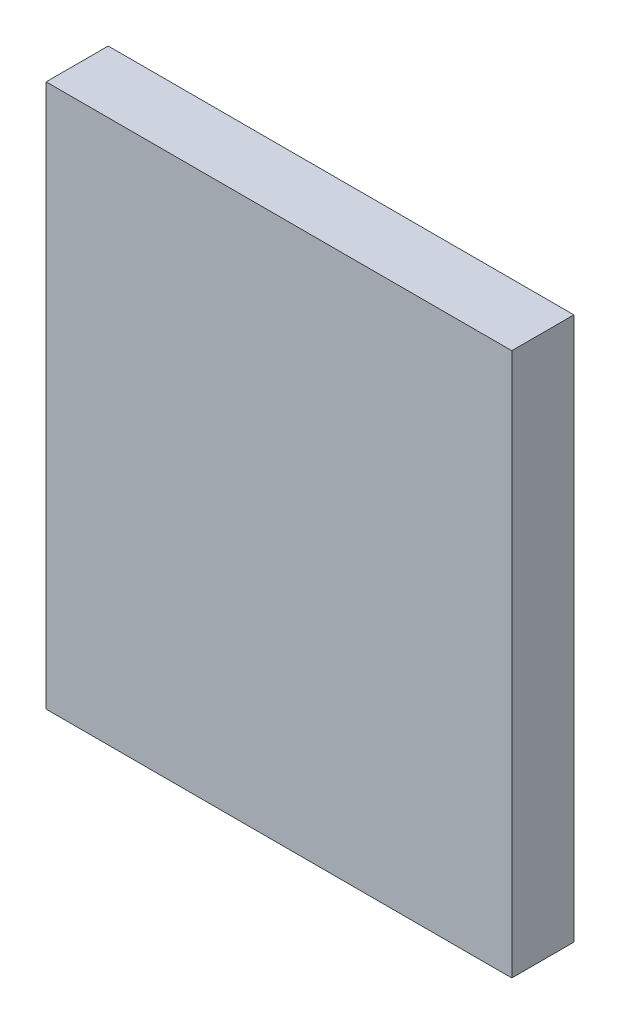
ISO-10303-21;
HEADER;
FILE_DESCRIPTION(('STEP AP214'),'2;1');
FILE_NAME('part.step','',(''),(''),'','','');
FILE_SCHEMA(('AUTOMOTIVE_DESIGN { 1 0 10303 214 1 1 1 1 }'));
ENDSEC;
DATA;
#1=APPLICATION_CONTEXT('core data for automotive mechanical design processes');
#2=APPLICATION_PROTOCOL_DEFINITION('international standard','automotive_design',2000,#1);
#3=PRODUCT_CONTEXT('',#1,'mechanical');
#4=PRODUCT('Part','Part','',(#3));
#5=PRODUCT_RELATED_PRODUCT_CATEGORY('part','',(#4));
#6=PRODUCT_DEFINITION_FORMATION('','',#4);
#7=PRODUCT_DEFINITION_CONTEXT('part definition',#1,'design');
#8=PRODUCT_DEFINITION('design','',#6,#7);
#9=PRODUCT_DEFINITION_SHAPE('','',#8);
#10=(LENGTH_UNIT() NAMED_UNIT(*) SI_UNIT(.MILLI.,.METRE.));
#11=(NAMED_UNIT(*) PLANE_ANGLE_UNIT() SI_UNIT($,.RADIAN.));
#12=(NAMED_UNIT(*) SI_UNIT($,.STERADIAN.) SOLID_ANGLE_UNIT());
#13=UNCERTAINTY_MEASURE_WITH_UNIT(LENGTH_MEASURE(1.E-05),#10,'distance_accuracy_value','');
#14=(GEOMETRIC_REPRESENTATION_CONTEXT(3) GLOBAL_UNCERTAINTY_ASSIGNED_CONTEXT((#13)) GLOBAL_UNIT_ASSIGNED_CONTEXT((#10,
#11,#12)) REPRESENTATION_CONTEXT('',''));
#15=CARTESIAN_POINT('',(0.,0.,0.));
#16=DIRECTION('',(0.,0.,1.));
#17=DIRECTION('',(1.,0.,0.));
#18=AXIS2_PLACEMENT_3D('',#15,#16,#17);
#19=CARTESIAN_POINT('',(0.,0.,8.));
#20=DIRECTION('',(0.,0.,1.));
#21=DIRECTION('',(1.,0.,0.));
#22=AXIS2_PLACEMENT_3D('',#19,#20,#21);
#23=PLANE('',#22);
#24=DIRECTION('',(1.,0.,0.));
#25=VECTOR('',#24,1.);
#26=CARTESIAN_POINT('',(-30.,-35.,8.));
#27=LINE('',#26,#25);
#28=CARTESIAN_POINT('',(-30.,-35.,8.));
#29=VERTEX_POINT('',#28);
#30=CARTESIAN_POINT('',(30.,-35.,8.));
#31=VERTEX_POINT('',#30);
#32=EDGE_CURVE('E82',#29,#31,#27,.T.);
#33=ORIENTED_EDGE('',*,*,#32,.T.);
#34=DIRECTION('',(0.,1.,0.));
#35=VECTOR('',#34,1.);
#36=CARTESIAN_POINT('',(30.,-35.,8.));
#37=LINE('',#36,#35);
#38=CARTESIAN_POINT('',(30.,35.,8.));
#39=VERTEX_POINT('',#38);
#40=EDGE_CURVE('E97',#31,#39,#37,.T.);
#41=ORIENTED_EDGE('',*,*,#40,.T.);
#42=DIRECTION('',(-1.,0.,0.));
#43=VECTOR('',#42,1.);
#44=CARTESIAN_POINT('',(30.,35.,8.));
#45=LINE('',#44,#43);
#46=CARTESIAN_POINT('',(-30.,35.,8.));
#47=VERTEX_POINT('',#46);
#48=EDGE_CURVE('E19',#39,#47,#45,.T.);
#49=ORIENTED_EDGE('',*,*,#48,.T.);
#50=DIRECTION('',(0.,-1.,0.));
#51=VECTOR('',#50,1.);
#52=CARTESIAN_POINT('',(-30.,35.,8.));
#53=LINE('',#52,#51);
#54=EDGE_CURVE('E10',#47,#29,#53,.T.);
#55=ORIENTED_EDGE('',*,*,#54,.T.);
#56=EDGE_LOOP('',(#33,#41,#49,#55));
#57=FACE_BOUND('',#56,.T.);
#58=ADVANCED_FACE('F16',(#57),#23,.T.);
#59=CARTESIAN_POINT('',(0.,0.,0.));
#60=DIRECTION('',(0.,0.,1.));
#61=DIRECTION('',(1.,0.,0.));
#62=AXIS2_PLACEMENT_3D('',#59,#60,#61);
#63=PLANE('',#62);
#64=DIRECTION('',(0.,-1.,0.));
#65=VECTOR('',#64,1.);
#66=CARTESIAN_POINT('',(-30.,35.,0.));
#67=LINE('',#66,#65);
#68=CARTESIAN_POINT('',(-30.,35.,0.));
#69=VERTEX_POINT('',#68);
#70=CARTESIAN_POINT('',(-30.,-35.,0.));
#71=VERTEX_POINT('',#70);
#72=EDGE_CURVE('E25',#69,#71,#67,.T.);
#73=ORIENTED_EDGE('',*,*,#72,.F.);
#74=DIRECTION('',(-1.,0.,0.));
#75=VECTOR('',#74,1.);
#76=CARTESIAN_POINT('',(30.,35.,0.));
#77=LINE('',#76,#75);
#78=CARTESIAN_POINT('',(30.,35.,0.));
#79=VERTEX_POINT('',#78);
#80=EDGE_CURVE('E107',#79,#69,#77,.T.);
#81=ORIENTED_EDGE('',*,*,#80,.F.);
#82=DIRECTION('',(0.,1.,0.));
#83=VECTOR('',#82,1.);
#84=CARTESIAN_POINT('',(30.,-35.,0.));
#85=LINE('',#84,#83);
#86=CARTESIAN_POINT('',(30.,-35.,0.));
#87=VERTEX_POINT('',#86);
#88=EDGE_CURVE('E84',#87,#79,#85,.T.);
#89=ORIENTED_EDGE('',*,*,#88,.F.);
#90=DIRECTION('',(1.,0.,0.));
#91=VECTOR('',#90,1.);
#92=CARTESIAN_POINT('',(-30.,-35.,0.));
#93=LINE('',#92,#91);
#94=EDGE_CURVE('E80',#71,#87,#93,.T.);
#95=ORIENTED_EDGE('',*,*,#94,.F.);
#96=EDGE_LOOP('',(#73,#81,#89,#95));
#97=FACE_BOUND('',#96,.T.);
#98=ADVANCED_FACE('F86',(#97),#63,.F.);
#99=CARTESIAN_POINT('',(-30.,35.,0.));
#100=DIRECTION('',(1.,0.,0.));
#101=DIRECTION('',(0.,1.,0.));
#102=AXIS2_PLACEMENT_3D('',#99,#100,#101);
#103=PLANE('',#102);
#104=ORIENTED_EDGE('',*,*,#72,.T.);
#105=DIRECTION('',(0.,0.,1.));
#106=VECTOR('',#105,1.);
#107=CARTESIAN_POINT('',(-30.,-35.,0.));
#108=LINE('',#107,#106);
#109=EDGE_CURVE('E69',#71,#29,#108,.T.);
#110=ORIENTED_EDGE('',*,*,#109,.T.);
#111=ORIENTED_EDGE('',*,*,#54,.F.);
#112=DIRECTION('',(0.,0.,1.));
#113=VECTOR('',#112,1.);
#114=CARTESIAN_POINT('',(-30.,35.,0.));
#115=LINE('',#114,#113);
#116=EDGE_CURVE('E72',#69,#47,#115,.T.);
#117=ORIENTED_EDGE('',*,*,#116,.F.);
#118=EDGE_LOOP('',(#104,#110,#111,#117));
#119=FACE_BOUND('',#118,.T.);
#120=ADVANCED_FACE('F68',(#119),#103,.F.);
#121=CARTESIAN_POINT('',(30.,35.,0.));
#122=DIRECTION('',(0.,-1.,0.));
#123=DIRECTION('',(0.,0.,-1.));
#124=AXIS2_PLACEMENT_3D('',#121,#122,#123);
#125=PLANE('',#124);
#126=ORIENTED_EDGE('',*,*,#80,.T.);
#127=ORIENTED_EDGE('',*,*,#116,.T.);
#128=ORIENTED_EDGE('',*,*,#48,.F.);
#129=DIRECTION('',(0.,0.,1.));
#130=VECTOR('',#129,1.);
#131=CARTESIAN_POINT('',(30.,35.,0.));
#132=LINE('',#131,#130);
#133=EDGE_CURVE('E103',#79,#39,#132,.T.);
#134=ORIENTED_EDGE('',*,*,#133,.F.);
#135=EDGE_LOOP('',(#126,#127,#128,#134));
#136=FACE_BOUND('',#135,.T.);
#137=ADVANCED_FACE('F118',(#136),#125,.F.);
#138=CARTESIAN_POINT('',(30.,-35.,0.));
#139=DIRECTION('',(-1.,0.,0.));
#140=DIRECTION('',(0.,0.,1.));
#141=AXIS2_PLACEMENT_3D('',#138,#139,#140);
#142=PLANE('',#141);
#143=ORIENTED_EDGE('',*,*,#88,.T.);
#144=ORIENTED_EDGE('',*,*,#133,.T.);
#145=ORIENTED_EDGE('',*,*,#40,.F.);
#146=DIRECTION('',(0.,0.,1.));
#147=VECTOR('',#146,1.);
#148=CARTESIAN_POINT('',(30.,-35.,0.));
#149=LINE('',#148,#147);
#150=EDGE_CURVE('E90',#87,#31,#149,.T.);
#151=ORIENTED_EDGE('',*,*,#150,.F.);
#152=EDGE_LOOP('',(#143,#144,#145,#151));
#153=FACE_BOUND('',#152,.T.);
#154=ADVANCED_FACE('F120',(#153),#142,.F.);
#155=CARTESIAN_POINT('',(-30.,-35.,0.));
#156=DIRECTION('',(0.,1.,0.));
#157=DIRECTION('',(1.,0.,0.));
#158=AXIS2_PLACEMENT_3D('',#155,#156,#157);
#159=PLANE('',#158);
#160=ORIENTED_EDGE('',*,*,#94,.T.);
#161=ORIENTED_EDGE('',*,*,#150,.T.);
#162=ORIENTED_EDGE('',*,*,#32,.F.);
#163=ORIENTED_EDGE('',*,*,#109,.F.);
#164=EDGE_LOOP('',(#160,#161,#162,#163));
#165=FACE_BOUND('',#164,.T.);
#166=ADVANCED_FACE('F78',(#165),#159,.F.);
#167=CLOSED_SHELL('',(#58,#98,#120,#137,#154,#166));
#168=MANIFOLD_SOLID_BREP('B1',#167);
#169=ADVANCED_BREP_SHAPE_REPRESENTATION('',(#18,#168),#14);
#170=SHAPE_DEFINITION_REPRESENTATION(#9,#169);
ENDSEC;
END-ISO-10303-21;
